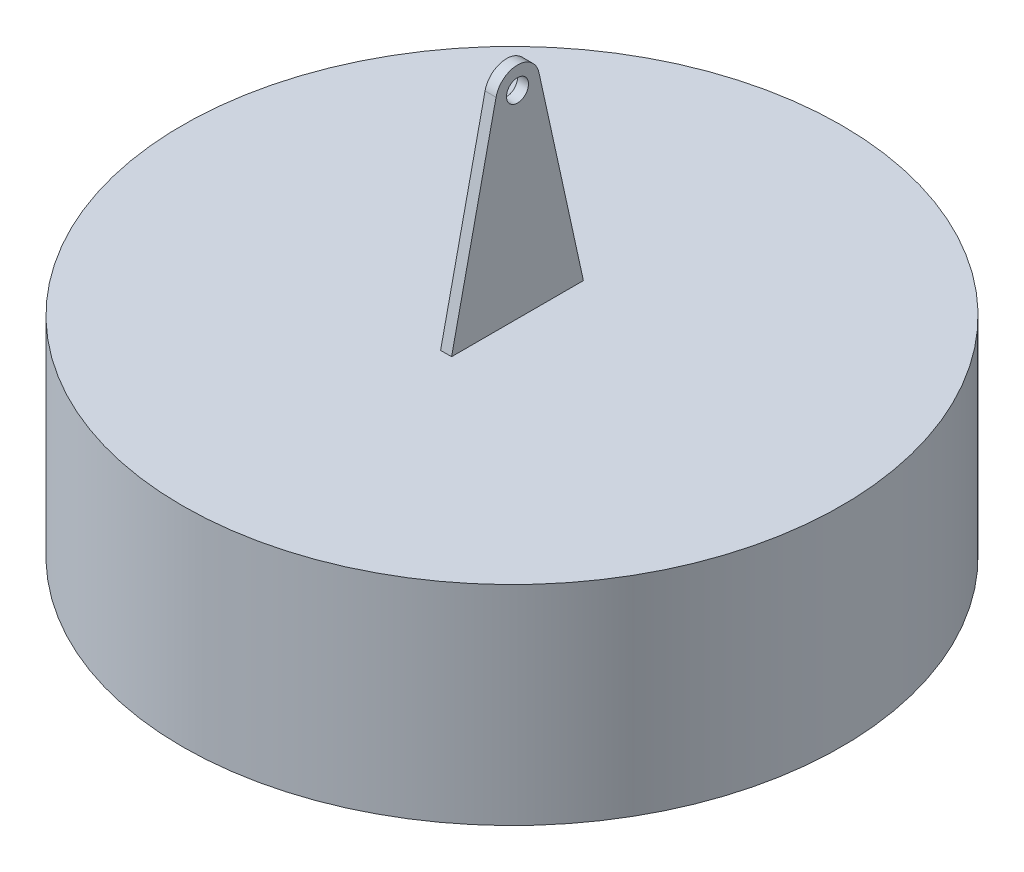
ISO-10303-21;
HEADER;
FILE_DESCRIPTION(('STEP AP214'),'2;1');
FILE_NAME('part.step','',(''),(''),'','','');
FILE_SCHEMA(('AUTOMOTIVE_DESIGN { 1 0 10303 214 1 1 1 1 }'));
ENDSEC;
DATA;
#1=APPLICATION_CONTEXT('core data for automotive mechanical design processes');
#2=APPLICATION_PROTOCOL_DEFINITION('international standard','automotive_design',2000,#1);
#3=PRODUCT_CONTEXT('',#1,'mechanical');
#4=PRODUCT('Part','Part','',(#3));
#5=PRODUCT_RELATED_PRODUCT_CATEGORY('part','',(#4));
#6=PRODUCT_DEFINITION_FORMATION('','',#4);
#7=PRODUCT_DEFINITION_CONTEXT('part definition',#1,'design');
#8=PRODUCT_DEFINITION('design','',#6,#7);
#9=PRODUCT_DEFINITION_SHAPE('','',#8);
#10=(LENGTH_UNIT() NAMED_UNIT(*) SI_UNIT(.MILLI.,.METRE.));
#11=(NAMED_UNIT(*) PLANE_ANGLE_UNIT() SI_UNIT($,.RADIAN.));
#12=(NAMED_UNIT(*) SI_UNIT($,.STERADIAN.) SOLID_ANGLE_UNIT());
#13=UNCERTAINTY_MEASURE_WITH_UNIT(LENGTH_MEASURE(1.E-05),#10,'distance_accuracy_value','');
#14=(GEOMETRIC_REPRESENTATION_CONTEXT(3) GLOBAL_UNCERTAINTY_ASSIGNED_CONTEXT((#13)) GLOBAL_UNIT_ASSIGNED_CONTEXT((#10,
#11,#12)) REPRESENTATION_CONTEXT('',''));
#15=CARTESIAN_POINT('',(0.,0.,0.));
#16=DIRECTION('',(0.,0.,1.));
#17=DIRECTION('',(1.,0.,0.));
#18=AXIS2_PLACEMENT_3D('',#15,#16,#17);
#19=CARTESIAN_POINT('',(0.,482.6,0.));
#20=DIRECTION('',(0.,1.,0.));
#21=DIRECTION('',(0.,0.,1.));
#22=AXIS2_PLACEMENT_3D('',#19,#20,#21);
#23=PLANE('',#22);
#24=CARTESIAN_POINT('',(0.,482.6,0.));
#25=DIRECTION('',(0.,1.,0.));
#26=DIRECTION('',(0.,0.,1.));
#27=AXIS2_PLACEMENT_3D('',#24,#25,#26);
#28=CIRCLE('',#27,762.);
#29=CARTESIAN_POINT('',(0.,482.6,-762.));
#30=VERTEX_POINT('',#29);
#31=EDGE_CURVE('E11',#30,#30,#28,.T.);
#32=ORIENTED_EDGE('',*,*,#31,.T.);
#33=EDGE_LOOP('',(#32));
#34=FACE_BOUND('',#33,.T.);
#35=DIRECTION('',(0.,0.,-1.));
#36=VECTOR('',#35,1.);
#37=CARTESIAN_POINT('',(12.7,482.6,-152.4));
#38=LINE('',#37,#36);
#39=CARTESIAN_POINT('',(12.7,482.6,152.4));
#40=VERTEX_POINT('',#39);
#41=CARTESIAN_POINT('',(12.7,482.6,-152.4));
#42=VERTEX_POINT('',#41);
#43=EDGE_CURVE('E91',#40,#42,#38,.T.);
#44=ORIENTED_EDGE('',*,*,#43,.F.);
#45=DIRECTION('',(-1.,0.,0.));
#46=VECTOR('',#45,1.);
#47=CARTESIAN_POINT('',(12.7,482.6,152.4));
#48=LINE('',#47,#46);
#49=CARTESIAN_POINT('',(-12.7,482.6,152.4));
#50=VERTEX_POINT('',#49);
#51=EDGE_CURVE('E89',#40,#50,#48,.T.);
#52=ORIENTED_EDGE('',*,*,#51,.T.);
#53=DIRECTION('',(0.,0.,-1.));
#54=VECTOR('',#53,1.);
#55=CARTESIAN_POINT('',(-12.7,482.6,-152.4));
#56=LINE('',#55,#54);
#57=CARTESIAN_POINT('',(-12.7,482.6,-152.4));
#58=VERTEX_POINT('',#57);
#59=EDGE_CURVE('E112',#50,#58,#56,.T.);
#60=ORIENTED_EDGE('',*,*,#59,.T.);
#61=DIRECTION('',(-1.,0.,0.));
#62=VECTOR('',#61,1.);
#63=CARTESIAN_POINT('',(12.7,482.6,-152.4));
#64=LINE('',#63,#62);
#65=EDGE_CURVE('E105',#42,#58,#64,.T.);
#66=ORIENTED_EDGE('',*,*,#65,.F.);
#67=EDGE_LOOP('',(#44,#52,#60,#66));
#68=FACE_BOUND('',#67,.T.);
#69=ADVANCED_FACE('F40',(#34,#68),#23,.T.);
#70=CARTESIAN_POINT('',(0.,482.6,0.));
#71=DIRECTION('',(0.,-1.,0.));
#72=DIRECTION('',(0.,0.,-1.));
#73=AXIS2_PLACEMENT_3D('',#70,#71,#72);
#74=CYLINDRICAL_SURFACE('',#73,762.);
#75=CARTESIAN_POINT('',(0.,0.,0.));
#76=DIRECTION('',(0.,1.,0.));
#77=DIRECTION('',(0.,0.,1.));
#78=AXIS2_PLACEMENT_3D('',#75,#76,#77);
#79=CIRCLE('',#78,762.);
#80=CARTESIAN_POINT('',(0.,0.,-762.));
#81=VERTEX_POINT('',#80);
#82=EDGE_CURVE('E44',#81,#81,#79,.T.);
#83=CARTESIAN_POINT('',(0.,482.6,-762.));
#84=CARTESIAN_POINT('',(0.,477.572916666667,-762.));
#85=CARTESIAN_POINT('',(0.,472.545833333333,-762.));
#86=CARTESIAN_POINT('',(0.,462.491666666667,-762.));
#87=CARTESIAN_POINT('',(0.,457.464583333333,-762.));
#88=CARTESIAN_POINT('',(0.,447.410416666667,-762.));
#89=CARTESIAN_POINT('',(0.,442.383333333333,-762.));
#90=CARTESIAN_POINT('',(0.,432.329166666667,-762.));
#91=CARTESIAN_POINT('',(0.,427.302083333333,-762.));
#92=CARTESIAN_POINT('',(0.,417.247916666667,-762.));
#93=CARTESIAN_POINT('',(0.,412.220833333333,-762.));
#94=CARTESIAN_POINT('',(0.,402.166666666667,-762.));
#95=CARTESIAN_POINT('',(0.,397.139583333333,-762.));
#96=CARTESIAN_POINT('',(0.,387.085416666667,-762.));
#97=CARTESIAN_POINT('',(0.,382.058333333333,-762.));
#98=CARTESIAN_POINT('',(0.,372.004166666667,-762.));
#99=CARTESIAN_POINT('',(0.,366.977083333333,-762.));
#100=CARTESIAN_POINT('',(0.,356.922916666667,-762.));
#101=CARTESIAN_POINT('',(0.,351.895833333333,-762.));
#102=CARTESIAN_POINT('',(0.,341.841666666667,-762.));
#103=CARTESIAN_POINT('',(0.,336.814583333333,-762.));
#104=CARTESIAN_POINT('',(0.,326.760416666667,-762.));
#105=CARTESIAN_POINT('',(0.,321.733333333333,-762.));
#106=CARTESIAN_POINT('',(0.,311.679166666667,-762.));
#107=CARTESIAN_POINT('',(0.,306.652083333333,-762.));
#108=CARTESIAN_POINT('',(0.,296.597916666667,-762.));
#109=CARTESIAN_POINT('',(0.,291.570833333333,-762.));
#110=CARTESIAN_POINT('',(0.,281.516666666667,-762.));
#111=CARTESIAN_POINT('',(0.,276.489583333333,-762.));
#112=CARTESIAN_POINT('',(0.,266.435416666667,-762.));
#113=CARTESIAN_POINT('',(0.,261.408333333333,-762.));
#114=CARTESIAN_POINT('',(0.,251.354166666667,-762.));
#115=CARTESIAN_POINT('',(0.,246.327083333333,-762.));
#116=CARTESIAN_POINT('',(0.,236.272916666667,-762.));
#117=CARTESIAN_POINT('',(0.,231.245833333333,-762.));
#118=CARTESIAN_POINT('',(0.,221.191666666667,-762.));
#119=CARTESIAN_POINT('',(0.,216.164583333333,-762.));
#120=CARTESIAN_POINT('',(0.,206.110416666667,-762.));
#121=CARTESIAN_POINT('',(0.,201.083333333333,-762.));
#122=CARTESIAN_POINT('',(0.,191.029166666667,-762.));
#123=CARTESIAN_POINT('',(0.,186.002083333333,-762.));
#124=CARTESIAN_POINT('',(0.,175.947916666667,-762.));
#125=CARTESIAN_POINT('',(0.,170.920833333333,-762.));
#126=CARTESIAN_POINT('',(0.,160.866666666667,-762.));
#127=CARTESIAN_POINT('',(0.,155.839583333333,-762.));
#128=CARTESIAN_POINT('',(0.,145.785416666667,-762.));
#129=CARTESIAN_POINT('',(0.,140.758333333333,-762.));
#130=CARTESIAN_POINT('',(0.,130.704166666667,-762.));
#131=CARTESIAN_POINT('',(0.,125.677083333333,-762.));
#132=CARTESIAN_POINT('',(0.,115.622916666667,-762.));
#133=CARTESIAN_POINT('',(0.,110.595833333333,-762.));
#134=CARTESIAN_POINT('',(0.,100.541666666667,-762.));
#135=CARTESIAN_POINT('',(0.,95.5145833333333,-762.));
#136=CARTESIAN_POINT('',(0.,85.4604166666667,-762.));
#137=CARTESIAN_POINT('',(0.,80.4333333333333,-762.));
#138=CARTESIAN_POINT('',(0.,70.3791666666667,-762.));
#139=CARTESIAN_POINT('',(0.,65.3520833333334,-762.));
#140=CARTESIAN_POINT('',(0.,55.2979166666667,-762.));
#141=CARTESIAN_POINT('',(0.,50.2708333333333,-762.));
#142=CARTESIAN_POINT('',(0.,40.2166666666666,-762.));
#143=CARTESIAN_POINT('',(0.,35.1895833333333,-762.));
#144=CARTESIAN_POINT('',(0.,25.1354166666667,-762.));
#145=CARTESIAN_POINT('',(0.,20.1083333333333,-762.));
#146=CARTESIAN_POINT('',(0.,10.0541666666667,-762.));
#147=CARTESIAN_POINT('',(0.,5.02708333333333,-762.));
#148=CARTESIAN_POINT('',(0.,0.,-762.));
#149=B_SPLINE_CURVE_WITH_KNOTS('',3,(#83,#84,#85,#86,#87,#88,#89,#90,#91,#92,#93,#94,#95,#96,
#97,#98,#99,#100,#101,#102,#103,#104,#105,#106,#107,#108,#109,#110,#111,#112,#113,#114,#115,
#116,#117,#118,#119,#120,#121,#122,#123,#124,#125,#126,#127,#128,#129,#130,#131,#132,#133,#134,
#135,#136,#137,#138,#139,#140,#141,#142,#143,#144,#145,#146,#147,#148),.UNSPECIFIED.,.F.,.F.,(4,
2,2,2,2,2,2,2,2,2,2,2,2,2,2,2,2,2,2,2,2,2,2,2,2,2,2,2,2,2,2,2,4),(0.,15.08125,30.1625,45.24375,
60.325,75.40625,90.4874999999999,105.56875,120.65,135.73125,150.8125,165.89375,180.975,
196.05625,211.1375,226.21875,241.3,256.38125,271.4625,286.54375,301.625,316.70625,331.7875,
346.86875,361.95,377.03125,392.1125,407.19375,422.275,437.35625,452.4375,467.51875,482.6),.UNSPECIFIED.);
#150=EDGE_CURVE('BSEAM42',#30,#81,#149,.T.);
#151=ORIENTED_EDGE('',*,*,#31,.F.);
#152=ORIENTED_EDGE('',*,*,#82,.T.);
#153=ORIENTED_EDGE('',*,*,#150,.T.);
#154=ORIENTED_EDGE('',*,*,#150,.F.);
#155=EDGE_LOOP('',(#151,#153,#152,#154));
#156=FACE_BOUND('',#155,.T.);
#157=ADVANCED_FACE('F42',(#156),#74,.T.);
#158=CARTESIAN_POINT('',(0.,0.,0.));
#159=DIRECTION('',(0.,1.,0.));
#160=DIRECTION('',(0.,0.,1.));
#161=AXIS2_PLACEMENT_3D('',#158,#159,#160);
#162=PLANE('',#161);
#163=ORIENTED_EDGE('',*,*,#82,.F.);
#164=EDGE_LOOP('',(#163));
#165=FACE_BOUND('',#164,.T.);
#166=ADVANCED_FACE('F131',(#165),#162,.F.);
#167=CARTESIAN_POINT('',(12.7,939.8,0.));
#168=DIRECTION('',(1.,0.,0.));
#169=DIRECTION('',(0.,0.,-1.));
#170=AXIS2_PLACEMENT_3D('',#167,#168,#169);
#171=PLANE('',#170);
#172=CARTESIAN_POINT('',(12.7,939.8,0.));
#173=DIRECTION('',(1.,0.,0.));
#174=DIRECTION('',(0.,0.,-1.));
#175=AXIS2_PLACEMENT_3D('',#172,#173,#174);
#176=CIRCLE('',#175,50.8);
#177=CARTESIAN_POINT('',(12.7,950.694874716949,-49.6179574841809));
#178=VERTEX_POINT('',#177);
#179=CARTESIAN_POINT('',(12.7,950.694874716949,49.6179574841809));
#180=VERTEX_POINT('',#179);
#181=EDGE_CURVE('E92',#178,#180,#176,.T.);
#182=ORIENTED_EDGE('',*,*,#181,.T.);
#183=DIRECTION('',(0.,-0.976731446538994,0.21446603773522));
#184=VECTOR('',#183,1.);
#185=CARTESIAN_POINT('',(12.7,482.6,152.4));
#186=LINE('',#185,#184);
#187=EDGE_CURVE('E83',#180,#40,#186,.T.);
#188=ORIENTED_EDGE('',*,*,#187,.T.);
#189=ORIENTED_EDGE('',*,*,#43,.T.);
#190=DIRECTION('',(0.,0.976731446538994,0.21446603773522));
#191=VECTOR('',#190,1.);
#192=CARTESIAN_POINT('',(12.7,950.694874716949,-49.6179574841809));
#193=LINE('',#192,#191);
#194=EDGE_CURVE('E56',#42,#178,#193,.T.);
#195=ORIENTED_EDGE('',*,*,#194,.T.);
#196=EDGE_LOOP('',(#182,#188,#189,#195));
#197=FACE_BOUND('',#196,.T.);
#198=CARTESIAN_POINT('',(12.7,939.8,0.));
#199=DIRECTION('',(1.,0.,0.));
#200=DIRECTION('',(0.,0.,-1.));
#201=AXIS2_PLACEMENT_3D('',#198,#199,#200);
#202=CIRCLE('',#201,25.4);
#203=CARTESIAN_POINT('',(12.7,939.8,-25.4));
#204=VERTEX_POINT('',#203);
#205=EDGE_CURVE('E118',#204,#204,#202,.T.);
#206=ORIENTED_EDGE('',*,*,#205,.F.);
#207=EDGE_LOOP('',(#206));
#208=FACE_BOUND('',#207,.T.);
#209=ADVANCED_FACE('F95',(#197,#208),#171,.T.);
#210=CARTESIAN_POINT('',(-12.7,939.8,0.));
#211=DIRECTION('',(1.,0.,0.));
#212=DIRECTION('',(0.,0.,-1.));
#213=AXIS2_PLACEMENT_3D('',#210,#211,#212);
#214=PLANE('',#213);
#215=CARTESIAN_POINT('',(-12.7,939.8,0.));
#216=DIRECTION('',(1.,0.,0.));
#217=DIRECTION('',(0.,0.,-1.));
#218=AXIS2_PLACEMENT_3D('',#215,#216,#217);
#219=CIRCLE('',#218,50.8);
#220=CARTESIAN_POINT('',(-12.7,950.694874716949,-49.6179574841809));
#221=VERTEX_POINT('',#220);
#222=CARTESIAN_POINT('',(-12.7,950.694874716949,49.6179574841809));
#223=VERTEX_POINT('',#222);
#224=EDGE_CURVE('E101',#221,#223,#219,.T.);
#225=ORIENTED_EDGE('',*,*,#224,.F.);
#226=DIRECTION('',(0.,0.976731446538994,0.21446603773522));
#227=VECTOR('',#226,1.);
#228=CARTESIAN_POINT('',(-12.7,950.694874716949,-49.6179574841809));
#229=LINE('',#228,#227);
#230=EDGE_CURVE('E77',#58,#221,#229,.T.);
#231=ORIENTED_EDGE('',*,*,#230,.F.);
#232=ORIENTED_EDGE('',*,*,#59,.F.);
#233=DIRECTION('',(0.,-0.976731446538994,0.21446603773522));
#234=VECTOR('',#233,1.);
#235=CARTESIAN_POINT('',(-12.7,482.6,152.4));
#236=LINE('',#235,#234);
#237=EDGE_CURVE('E115',#223,#50,#236,.T.);
#238=ORIENTED_EDGE('',*,*,#237,.F.);
#239=EDGE_LOOP('',(#225,#231,#232,#238));
#240=FACE_BOUND('',#239,.T.);
#241=CARTESIAN_POINT('',(-12.7,939.8,0.));
#242=DIRECTION('',(1.,0.,0.));
#243=DIRECTION('',(0.,0.,-1.));
#244=AXIS2_PLACEMENT_3D('',#241,#242,#243);
#245=CIRCLE('',#244,25.4);
#246=CARTESIAN_POINT('',(-12.7,939.8,-25.4));
#247=VERTEX_POINT('',#246);
#248=EDGE_CURVE('E121',#247,#247,#245,.T.);
#249=ORIENTED_EDGE('',*,*,#248,.T.);
#250=EDGE_LOOP('',(#249));
#251=FACE_BOUND('',#250,.T.);
#252=ADVANCED_FACE('F130',(#240,#251),#214,.F.);
#253=CARTESIAN_POINT('',(12.7,939.8,0.));
#254=DIRECTION('',(-1.,0.,0.));
#255=DIRECTION('',(0.,0.,1.));
#256=AXIS2_PLACEMENT_3D('',#253,#254,#255);
#257=CYLINDRICAL_SURFACE('',#256,50.8);
#258=ORIENTED_EDGE('',*,*,#224,.T.);
#259=DIRECTION('',(-1.,0.,0.));
#260=VECTOR('',#259,1.);
#261=CARTESIAN_POINT('',(12.7,950.694874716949,49.6179574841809));
#262=LINE('',#261,#260);
#263=EDGE_CURVE('E86',#180,#223,#262,.T.);
#264=ORIENTED_EDGE('',*,*,#263,.F.);
#265=ORIENTED_EDGE('',*,*,#181,.F.);
#266=DIRECTION('',(-1.,0.,0.));
#267=VECTOR('',#266,1.);
#268=CARTESIAN_POINT('',(12.7,950.694874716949,-49.6179574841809));
#269=LINE('',#268,#267);
#270=EDGE_CURVE('E109',#178,#221,#269,.T.);
#271=ORIENTED_EDGE('',*,*,#270,.T.);
#272=EDGE_LOOP('',(#258,#264,#265,#271));
#273=FACE_BOUND('',#272,.T.);
#274=ADVANCED_FACE('F99',(#273),#257,.T.);
#275=CARTESIAN_POINT('',(12.7,482.6,152.4));
#276=DIRECTION('',(0.,-0.21446603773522,-0.976731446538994));
#277=DIRECTION('',(0.,0.976731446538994,-0.21446603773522));
#278=AXIS2_PLACEMENT_3D('',#275,#276,#277);
#279=PLANE('',#278);
#280=ORIENTED_EDGE('',*,*,#237,.T.);
#281=ORIENTED_EDGE('',*,*,#51,.F.);
#282=ORIENTED_EDGE('',*,*,#187,.F.);
#283=ORIENTED_EDGE('',*,*,#263,.T.);
#284=EDGE_LOOP('',(#280,#281,#282,#283));
#285=FACE_BOUND('',#284,.T.);
#286=ADVANCED_FACE('F84',(#285),#279,.F.);
#287=CARTESIAN_POINT('',(12.7,950.694874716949,-49.6179574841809));
#288=DIRECTION('',(0.,-0.21446603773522,0.976731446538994));
#289=DIRECTION('',(0.,-0.976731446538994,-0.21446603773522));
#290=AXIS2_PLACEMENT_3D('',#287,#288,#289);
#291=PLANE('',#290);
#292=ORIENTED_EDGE('',*,*,#230,.T.);
#293=ORIENTED_EDGE('',*,*,#270,.F.);
#294=ORIENTED_EDGE('',*,*,#194,.F.);
#295=ORIENTED_EDGE('',*,*,#65,.T.);
#296=EDGE_LOOP('',(#292,#293,#294,#295));
#297=FACE_BOUND('',#296,.T.);
#298=ADVANCED_FACE('F154',(#297),#291,.F.);
#299=CARTESIAN_POINT('',(12.7,939.8,0.));
#300=DIRECTION('',(-1.,0.,0.));
#301=DIRECTION('',(0.,0.,1.));
#302=AXIS2_PLACEMENT_3D('',#299,#300,#301);
#303=CYLINDRICAL_SURFACE('',#302,25.4);
#304=ORIENTED_EDGE('',*,*,#205,.T.);
#305=EDGE_LOOP('',(#304));
#306=FACE_BOUND('',#305,.T.);
#307=ORIENTED_EDGE('',*,*,#248,.F.);
#308=EDGE_LOOP('',(#307));
#309=FACE_BOUND('',#308,.T.);
#310=ADVANCED_FACE('F127',(#306,#309),#303,.F.);
#311=CLOSED_SHELL('',(#69,#157,#166,#209,#252,#274,#286,#298,#310));
#312=MANIFOLD_SOLID_BREP('B2',#311);
#313=ADVANCED_BREP_SHAPE_REPRESENTATION('',(#18,#312),#14);
#314=SHAPE_DEFINITION_REPRESENTATION(#9,#313);
ENDSEC;
END-ISO-10303-21;
